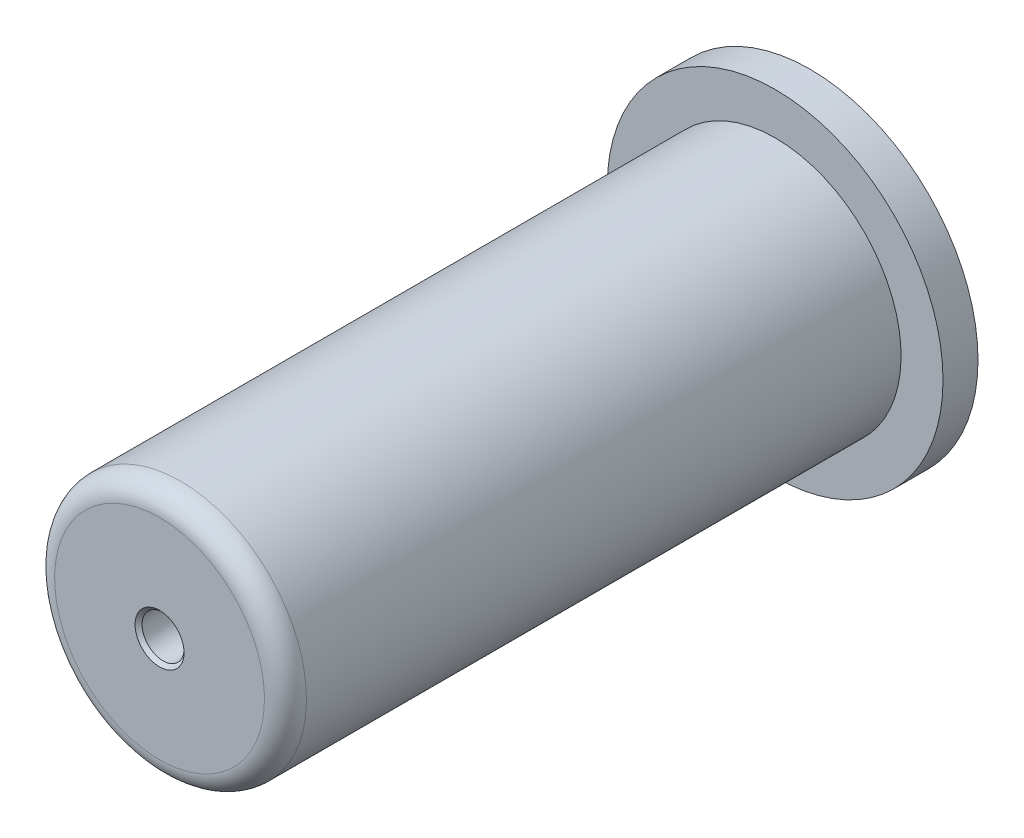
from build123d import *


with BuildPart() as part:
    # Sketch1 → Revolve1 (revolve)
    with BuildSketch(Plane(origin=(0, 0, 0), x_dir=(0, 0, -1), z_dir=(1, 0, 0))):
        with BuildLine():
            Line((0, 0), (0, 24))
            Line((0, 24), (-5, 24))
            Line((-5, 24), (-5, 18))
            Line((-5, 18), (-90, 18))
            ThreePointArc((-90, 18), (-92.121320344, 17.121320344), (-93, 15))
            Line((-93, 15), (-93, 3.5))
            Line((-93, 3.5), (-92.5, 3))
            Line((-92.5, 3), (-84, 3))
            Line((-84, 3), (-82.267949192, 0))
            Line((-82.267949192, 0), (0, 0))
        make_face()
    revolve(axis=Axis((0, 0, 0), (0, 0, 1)))


solid = part.part
